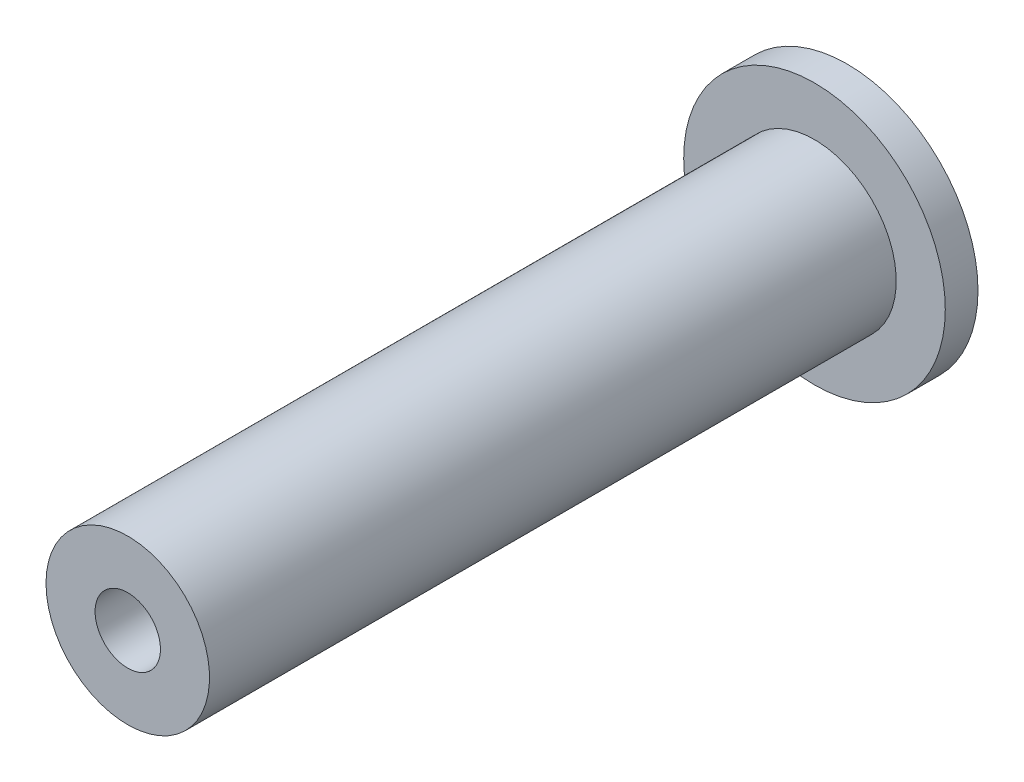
ISO-10303-21;
HEADER;
FILE_DESCRIPTION(('STEP AP214'),'2;1');
FILE_NAME('part.step','',(''),(''),'','','');
FILE_SCHEMA(('AUTOMOTIVE_DESIGN { 1 0 10303 214 1 1 1 1 }'));
ENDSEC;
DATA;
#1=APPLICATION_CONTEXT('core data for automotive mechanical design processes');
#2=APPLICATION_PROTOCOL_DEFINITION('international standard','automotive_design',2000,#1);
#3=PRODUCT_CONTEXT('',#1,'mechanical');
#4=PRODUCT('Part','Part','',(#3));
#5=PRODUCT_RELATED_PRODUCT_CATEGORY('part','',(#4));
#6=PRODUCT_DEFINITION_FORMATION('','',#4);
#7=PRODUCT_DEFINITION_CONTEXT('part definition',#1,'design');
#8=PRODUCT_DEFINITION('design','',#6,#7);
#9=PRODUCT_DEFINITION_SHAPE('','',#8);
#10=(LENGTH_UNIT() NAMED_UNIT(*) SI_UNIT(.MILLI.,.METRE.));
#11=(NAMED_UNIT(*) PLANE_ANGLE_UNIT() SI_UNIT($,.RADIAN.));
#12=(NAMED_UNIT(*) SI_UNIT($,.STERADIAN.) SOLID_ANGLE_UNIT());
#13=UNCERTAINTY_MEASURE_WITH_UNIT(LENGTH_MEASURE(1.E-05),#10,'distance_accuracy_value','');
#14=(GEOMETRIC_REPRESENTATION_CONTEXT(3) GLOBAL_UNCERTAINTY_ASSIGNED_CONTEXT((#13)) GLOBAL_UNIT_ASSIGNED_CONTEXT((#10,
#11,#12)) REPRESENTATION_CONTEXT('',''));
#15=CARTESIAN_POINT('',(0.,0.,0.));
#16=DIRECTION('',(0.,0.,1.));
#17=DIRECTION('',(1.,0.,0.));
#18=AXIS2_PLACEMENT_3D('',#15,#16,#17);
#19=CARTESIAN_POINT('',(0.,0.,0.5));
#20=DIRECTION('',(0.,0.,-1.));
#21=DIRECTION('',(-1.,0.,0.));
#22=AXIS2_PLACEMENT_3D('',#19,#20,#21);
#23=CYLINDRICAL_SURFACE('',#22,2.);
#24=CARTESIAN_POINT('',(0.,0.,0.5));
#25=DIRECTION('',(0.,0.,1.));
#26=DIRECTION('',(1.,0.,0.));
#27=AXIS2_PLACEMENT_3D('',#24,#25,#26);
#28=CIRCLE('',#27,2.);
#29=CARTESIAN_POINT('',(2.,0.,0.5));
#30=VERTEX_POINT('',#29);
#31=EDGE_CURVE('E39',#30,#30,#28,.T.);
#32=ORIENTED_EDGE('',*,*,#31,.F.);
#33=EDGE_LOOP('',(#32));
#34=FACE_BOUND('',#33,.T.);
#35=CARTESIAN_POINT('',(0.,0.,0.));
#36=DIRECTION('',(0.,0.,1.));
#37=DIRECTION('',(1.,0.,0.));
#38=AXIS2_PLACEMENT_3D('',#35,#36,#37);
#39=CIRCLE('',#38,2.);
#40=CARTESIAN_POINT('',(2.,0.,0.));
#41=VERTEX_POINT('',#40);
#42=EDGE_CURVE('E35',#41,#41,#39,.T.);
#43=ORIENTED_EDGE('',*,*,#42,.T.);
#44=EDGE_LOOP('',(#43));
#45=FACE_BOUND('',#44,.T.);
#46=ADVANCED_FACE('F32',(#34,#45),#23,.T.);
#47=CARTESIAN_POINT('',(0.,0.,0.5));
#48=DIRECTION('',(0.,0.,1.));
#49=DIRECTION('',(1.,0.,0.));
#50=AXIS2_PLACEMENT_3D('',#47,#48,#49);
#51=PLANE('',#50);
#52=CARTESIAN_POINT('',(0.,0.,0.5));
#53=DIRECTION('',(0.,0.,1.));
#54=DIRECTION('',(1.,0.,0.));
#55=AXIS2_PLACEMENT_3D('',#52,#53,#54);
#56=CIRCLE('',#55,1.25);
#57=CARTESIAN_POINT('',(-1.25,0.,0.5));
#58=VERTEX_POINT('',#57);
#59=EDGE_CURVE('E10',#58,#58,#56,.T.);
#60=ORIENTED_EDGE('',*,*,#59,.F.);
#61=EDGE_LOOP('',(#60));
#62=FACE_BOUND('',#61,.T.);
#63=ORIENTED_EDGE('',*,*,#31,.T.);
#64=EDGE_LOOP('',(#63));
#65=FACE_BOUND('',#64,.T.);
#66=ADVANCED_FACE('F76',(#62,#65),#51,.T.);
#67=CARTESIAN_POINT('',(0.,0.,0.));
#68=DIRECTION('',(0.,0.,1.));
#69=DIRECTION('',(1.,0.,0.));
#70=AXIS2_PLACEMENT_3D('',#67,#68,#69);
#71=PLANE('',#70);
#72=ORIENTED_EDGE('',*,*,#42,.F.);
#73=EDGE_LOOP('',(#72));
#74=FACE_BOUND('',#73,.T.);
#75=ADVANCED_FACE('F71',(#74),#71,.F.);
#76=CARTESIAN_POINT('',(0.,0.,11.));
#77=DIRECTION('',(0.,0.,-1.));
#78=DIRECTION('',(-1.,0.,0.));
#79=AXIS2_PLACEMENT_3D('',#76,#77,#78);
#80=CYLINDRICAL_SURFACE('',#79,1.25);
#81=CARTESIAN_POINT('',(0.,0.,11.));
#82=DIRECTION('',(0.,0.,1.));
#83=DIRECTION('',(1.,0.,0.));
#84=AXIS2_PLACEMENT_3D('',#81,#82,#83);
#85=CIRCLE('',#84,1.25);
#86=CARTESIAN_POINT('',(-1.25,0.,11.));
#87=VERTEX_POINT('',#86);
#88=EDGE_CURVE('E45',#87,#87,#85,.T.);
#89=CARTESIAN_POINT('',(-1.25,0.,11.));
#90=CARTESIAN_POINT('',(-1.25,0.,10.890625));
#91=CARTESIAN_POINT('',(-1.25,0.,10.78125));
#92=CARTESIAN_POINT('',(-1.25,0.,10.5625));
#93=CARTESIAN_POINT('',(-1.25,0.,10.453125));
#94=CARTESIAN_POINT('',(-1.25,0.,10.234375));
#95=CARTESIAN_POINT('',(-1.25,0.,10.125));
#96=CARTESIAN_POINT('',(-1.25,0.,9.90625));
#97=CARTESIAN_POINT('',(-1.25,0.,9.796875));
#98=CARTESIAN_POINT('',(-1.25,0.,9.578125));
#99=CARTESIAN_POINT('',(-1.25,0.,9.46875));
#100=CARTESIAN_POINT('',(-1.25,0.,9.25));
#101=CARTESIAN_POINT('',(-1.25,0.,9.140625));
#102=CARTESIAN_POINT('',(-1.25,0.,8.921875));
#103=CARTESIAN_POINT('',(-1.25,0.,8.8125));
#104=CARTESIAN_POINT('',(-1.25,0.,8.59375));
#105=CARTESIAN_POINT('',(-1.25,0.,8.484375));
#106=CARTESIAN_POINT('',(-1.25,0.,8.265625));
#107=CARTESIAN_POINT('',(-1.25,0.,8.15625));
#108=CARTESIAN_POINT('',(-1.25,0.,7.9375));
#109=CARTESIAN_POINT('',(-1.25,0.,7.828125));
#110=CARTESIAN_POINT('',(-1.25,0.,7.609375));
#111=CARTESIAN_POINT('',(-1.25,0.,7.5));
#112=CARTESIAN_POINT('',(-1.25,0.,7.28125));
#113=CARTESIAN_POINT('',(-1.25,0.,7.171875));
#114=CARTESIAN_POINT('',(-1.25,0.,6.953125));
#115=CARTESIAN_POINT('',(-1.25,0.,6.84375));
#116=CARTESIAN_POINT('',(-1.25,0.,6.625));
#117=CARTESIAN_POINT('',(-1.25,0.,6.515625));
#118=CARTESIAN_POINT('',(-1.25,0.,6.296875));
#119=CARTESIAN_POINT('',(-1.25,0.,6.1875));
#120=CARTESIAN_POINT('',(-1.25,0.,5.96875));
#121=CARTESIAN_POINT('',(-1.25,0.,5.859375));
#122=CARTESIAN_POINT('',(-1.25,0.,5.640625));
#123=CARTESIAN_POINT('',(-1.25,0.,5.53125));
#124=CARTESIAN_POINT('',(-1.25,0.,5.3125));
#125=CARTESIAN_POINT('',(-1.25,0.,5.203125));
#126=CARTESIAN_POINT('',(-1.25,0.,4.984375));
#127=CARTESIAN_POINT('',(-1.25,0.,4.875));
#128=CARTESIAN_POINT('',(-1.25,0.,4.65625));
#129=CARTESIAN_POINT('',(-1.25,0.,4.546875));
#130=CARTESIAN_POINT('',(-1.25,0.,4.328125));
#131=CARTESIAN_POINT('',(-1.25,0.,4.21875));
#132=CARTESIAN_POINT('',(-1.25,0.,4.));
#133=CARTESIAN_POINT('',(-1.25,0.,3.890625));
#134=CARTESIAN_POINT('',(-1.25,0.,3.671875));
#135=CARTESIAN_POINT('',(-1.25,0.,3.5625));
#136=CARTESIAN_POINT('',(-1.25,0.,3.34375));
#137=CARTESIAN_POINT('',(-1.25,0.,3.234375));
#138=CARTESIAN_POINT('',(-1.25,0.,3.015625));
#139=CARTESIAN_POINT('',(-1.25,0.,2.90625));
#140=CARTESIAN_POINT('',(-1.25,0.,2.6875));
#141=CARTESIAN_POINT('',(-1.25,0.,2.578125));
#142=CARTESIAN_POINT('',(-1.25,0.,2.359375));
#143=CARTESIAN_POINT('',(-1.25,0.,2.25));
#144=CARTESIAN_POINT('',(-1.25,0.,2.03125));
#145=CARTESIAN_POINT('',(-1.25,0.,1.921875));
#146=CARTESIAN_POINT('',(-1.25,0.,1.703125));
#147=CARTESIAN_POINT('',(-1.25,0.,1.59375));
#148=CARTESIAN_POINT('',(-1.25,0.,1.375));
#149=CARTESIAN_POINT('',(-1.25,0.,1.265625));
#150=CARTESIAN_POINT('',(-1.25,0.,1.046875));
#151=CARTESIAN_POINT('',(-1.25,0.,0.937500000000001));
#152=CARTESIAN_POINT('',(-1.25,0.,0.718750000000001));
#153=CARTESIAN_POINT('',(-1.25,0.,0.609375));
#154=CARTESIAN_POINT('',(-1.25,0.,0.5));
#155=B_SPLINE_CURVE_WITH_KNOTS('',3,(#89,#90,#91,#92,#93,#94,#95,#96,#97,#98,#99,#100,#101,#102,
#103,#104,#105,#106,#107,#108,#109,#110,#111,#112,#113,#114,#115,#116,#117,#118,#119,#120,#121,
#122,#123,#124,#125,#126,#127,#128,#129,#130,#131,#132,#133,#134,#135,#136,#137,#138,#139,#140,
#141,#142,#143,#144,#145,#146,#147,#148,#149,#150,#151,#152,#153,#154),.UNSPECIFIED.,.F.,.F.,(4,
2,2,2,2,2,2,2,2,2,2,2,2,2,2,2,2,2,2,2,2,2,2,2,2,2,2,2,2,2,2,2,4),(0.,0.328125,0.656250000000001,
0.984375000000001,1.3125,1.640625,1.96875,2.296875,2.625,2.953125,3.28125,3.609375,3.9375,
4.265625,4.59375,4.921875,5.25,5.578125,5.90625,6.234375,6.5625,6.890625,7.21875,7.546875,7.875,
8.203125,8.53125,8.859375,9.1875,9.515625,9.84375,10.171875,10.5),.UNSPECIFIED.);
#156=EDGE_CURVE('BSEAM66',#87,#58,#155,.T.);
#157=ORIENTED_EDGE('',*,*,#88,.F.);
#158=ORIENTED_EDGE('',*,*,#59,.T.);
#159=ORIENTED_EDGE('',*,*,#156,.T.);
#160=ORIENTED_EDGE('',*,*,#156,.F.);
#161=EDGE_LOOP('',(#157,#159,#158,#160));
#162=FACE_BOUND('',#161,.T.);
#163=ADVANCED_FACE('F66',(#162),#80,.T.);
#164=CARTESIAN_POINT('',(0.,0.,11.));
#165=DIRECTION('',(0.,0.,1.));
#166=DIRECTION('',(1.,0.,0.));
#167=AXIS2_PLACEMENT_3D('',#164,#165,#166);
#168=PLANE('',#167);
#169=CARTESIAN_POINT('',(0.,0.,11.));
#170=DIRECTION('',(0.,0.,1.));
#171=DIRECTION('',(1.,0.,0.));
#172=AXIS2_PLACEMENT_3D('',#169,#170,#171);
#173=CIRCLE('',#172,0.5);
#174=CARTESIAN_POINT('',(0.5,0.,11.));
#175=VERTEX_POINT('',#174);
#176=EDGE_CURVE('E49',#175,#175,#173,.T.);
#177=ORIENTED_EDGE('',*,*,#176,.F.);
#178=EDGE_LOOP('',(#177));
#179=FACE_BOUND('',#178,.T.);
#180=ORIENTED_EDGE('',*,*,#88,.T.);
#181=EDGE_LOOP('',(#180));
#182=FACE_BOUND('',#181,.T.);
#183=ADVANCED_FACE('F60',(#179,#182),#168,.T.);
#184=CARTESIAN_POINT('',(0.,0.,9.));
#185=DIRECTION('',(0.,0.,1.));
#186=DIRECTION('',(1.,0.,0.));
#187=AXIS2_PLACEMENT_3D('',#184,#185,#186);
#188=CYLINDRICAL_SURFACE('',#187,0.5);
#189=CARTESIAN_POINT('',(0.,0.,9.));
#190=DIRECTION('',(0.,0.,1.));
#191=DIRECTION('',(1.,0.,0.));
#192=AXIS2_PLACEMENT_3D('',#189,#190,#191);
#193=CIRCLE('',#192,0.5);
#194=CARTESIAN_POINT('',(0.5,0.,9.));
#195=VERTEX_POINT('',#194);
#196=EDGE_CURVE('E48',#195,#195,#193,.T.);
#197=ORIENTED_EDGE('',*,*,#196,.F.);
#198=EDGE_LOOP('',(#197));
#199=FACE_BOUND('',#198,.T.);
#200=ORIENTED_EDGE('',*,*,#176,.T.);
#201=EDGE_LOOP('',(#200));
#202=FACE_BOUND('',#201,.T.);
#203=ADVANCED_FACE('F57',(#199,#202),#188,.F.);
#204=CARTESIAN_POINT('',(0.,0.,9.));
#205=DIRECTION('',(0.,0.,1.));
#206=DIRECTION('',(1.,0.,0.));
#207=AXIS2_PLACEMENT_3D('',#204,#205,#206);
#208=PLANE('',#207);
#209=ORIENTED_EDGE('',*,*,#196,.T.);
#210=EDGE_LOOP('',(#209));
#211=FACE_BOUND('',#210,.T.);
#212=ADVANCED_FACE('F55',(#211),#208,.T.);
#213=CLOSED_SHELL('',(#46,#66,#75,#163,#183,#203,#212));
#214=MANIFOLD_SOLID_BREP('B2',#213);
#215=ADVANCED_BREP_SHAPE_REPRESENTATION('',(#18,#214),#14);
#216=SHAPE_DEFINITION_REPRESENTATION(#9,#215);
ENDSEC;
END-ISO-10303-21;
